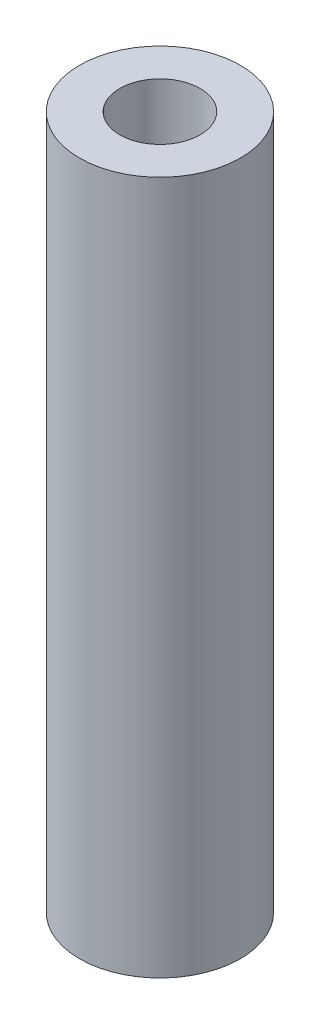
ISO-10303-21;
HEADER;
FILE_DESCRIPTION(('STEP AP214'),'2;1');
FILE_NAME('part.step','',(''),(''),'','','');
FILE_SCHEMA(('AUTOMOTIVE_DESIGN { 1 0 10303 214 1 1 1 1 }'));
ENDSEC;
DATA;
#1=APPLICATION_CONTEXT('core data for automotive mechanical design processes');
#2=APPLICATION_PROTOCOL_DEFINITION('international standard','automotive_design',2000,#1);
#3=PRODUCT_CONTEXT('',#1,'mechanical');
#4=PRODUCT('Part','Part','',(#3));
#5=PRODUCT_RELATED_PRODUCT_CATEGORY('part','',(#4));
#6=PRODUCT_DEFINITION_FORMATION('','',#4);
#7=PRODUCT_DEFINITION_CONTEXT('part definition',#1,'design');
#8=PRODUCT_DEFINITION('design','',#6,#7);
#9=PRODUCT_DEFINITION_SHAPE('','',#8);
#10=(LENGTH_UNIT() NAMED_UNIT(*) SI_UNIT(.MILLI.,.METRE.));
#11=(NAMED_UNIT(*) PLANE_ANGLE_UNIT() SI_UNIT($,.RADIAN.));
#12=(NAMED_UNIT(*) SI_UNIT($,.STERADIAN.) SOLID_ANGLE_UNIT());
#13=UNCERTAINTY_MEASURE_WITH_UNIT(LENGTH_MEASURE(1.E-05),#10,'distance_accuracy_value','');
#14=(GEOMETRIC_REPRESENTATION_CONTEXT(3) GLOBAL_UNCERTAINTY_ASSIGNED_CONTEXT((#13)) GLOBAL_UNIT_ASSIGNED_CONTEXT((#10,
#11,#12)) REPRESENTATION_CONTEXT('',''));
#15=CARTESIAN_POINT('',(0.,0.,0.));
#16=DIRECTION('',(0.,0.,1.));
#17=DIRECTION('',(1.,0.,0.));
#18=AXIS2_PLACEMENT_3D('',#15,#16,#17);
#19=CARTESIAN_POINT('',(0.,70.104,0.));
#20=DIRECTION('',(0.,-1.,0.));
#21=DIRECTION('',(0.,0.,-1.));
#22=AXIS2_PLACEMENT_3D('',#19,#20,#21);
#23=CYLINDRICAL_SURFACE('',#22,8.128);
#24=CARTESIAN_POINT('',(0.,70.104,0.));
#25=DIRECTION('',(0.,1.,0.));
#26=DIRECTION('',(0.,0.,1.));
#27=AXIS2_PLACEMENT_3D('',#24,#25,#26);
#28=CIRCLE('',#27,8.128);
#29=CARTESIAN_POINT('',(0.,70.104,8.128));
#30=VERTEX_POINT('',#29);
#31=EDGE_CURVE('E10',#30,#30,#28,.T.);
#32=ORIENTED_EDGE('',*,*,#31,.F.);
#33=EDGE_LOOP('',(#32));
#34=FACE_BOUND('',#33,.T.);
#35=CARTESIAN_POINT('',(0.,0.,0.));
#36=DIRECTION('',(0.,1.,0.));
#37=DIRECTION('',(0.,0.,1.));
#38=AXIS2_PLACEMENT_3D('',#35,#36,#37);
#39=CIRCLE('',#38,8.128);
#40=CARTESIAN_POINT('',(0.,0.,8.128));
#41=VERTEX_POINT('',#40);
#42=EDGE_CURVE('E40',#41,#41,#39,.T.);
#43=ORIENTED_EDGE('',*,*,#42,.T.);
#44=EDGE_LOOP('',(#43));
#45=FACE_BOUND('',#44,.T.);
#46=ADVANCED_FACE('F37',(#34,#45),#23,.T.);
#47=CARTESIAN_POINT('',(0.,70.104,0.));
#48=DIRECTION('',(0.,1.,0.));
#49=DIRECTION('',(0.,0.,1.));
#50=AXIS2_PLACEMENT_3D('',#47,#48,#49);
#51=PLANE('',#50);
#52=CARTESIAN_POINT('',(0.,70.104,0.));
#53=DIRECTION('',(0.,1.,0.));
#54=DIRECTION('',(0.,0.,1.));
#55=AXIS2_PLACEMENT_3D('',#52,#53,#54);
#56=CIRCLE('',#55,4.064);
#57=CARTESIAN_POINT('',(0.,70.104,4.064));
#58=VERTEX_POINT('',#57);
#59=EDGE_CURVE('E51',#58,#58,#56,.T.);
#60=ORIENTED_EDGE('',*,*,#59,.F.);
#61=EDGE_LOOP('',(#60));
#62=FACE_BOUND('',#61,.T.);
#63=ORIENTED_EDGE('',*,*,#31,.T.);
#64=EDGE_LOOP('',(#63));
#65=FACE_BOUND('',#64,.T.);
#66=ADVANCED_FACE('F68',(#62,#65),#51,.T.);
#67=CARTESIAN_POINT('',(0.,0.,0.));
#68=DIRECTION('',(0.,1.,0.));
#69=DIRECTION('',(0.,0.,1.));
#70=AXIS2_PLACEMENT_3D('',#67,#68,#69);
#71=PLANE('',#70);
#72=CARTESIAN_POINT('',(0.,0.,0.));
#73=DIRECTION('',(0.,1.,0.));
#74=DIRECTION('',(0.,0.,1.));
#75=AXIS2_PLACEMENT_3D('',#72,#73,#74);
#76=CIRCLE('',#75,4.064);
#77=CARTESIAN_POINT('',(0.,0.,4.064));
#78=VERTEX_POINT('',#77);
#79=EDGE_CURVE('E49',#78,#78,#76,.T.);
#80=ORIENTED_EDGE('',*,*,#79,.T.);
#81=EDGE_LOOP('',(#80));
#82=FACE_BOUND('',#81,.T.);
#83=ORIENTED_EDGE('',*,*,#42,.F.);
#84=EDGE_LOOP('',(#83));
#85=FACE_BOUND('',#84,.T.);
#86=ADVANCED_FACE('F59',(#82,#85),#71,.F.);
#87=CARTESIAN_POINT('',(0.,0.,0.));
#88=DIRECTION('',(0.,1.,0.));
#89=DIRECTION('',(0.,0.,1.));
#90=AXIS2_PLACEMENT_3D('',#87,#88,#89);
#91=CYLINDRICAL_SURFACE('',#90,4.064);
#92=ORIENTED_EDGE('',*,*,#79,.F.);
#93=EDGE_LOOP('',(#92));
#94=FACE_BOUND('',#93,.T.);
#95=ORIENTED_EDGE('',*,*,#59,.T.);
#96=EDGE_LOOP('',(#95));
#97=FACE_BOUND('',#96,.T.);
#98=ADVANCED_FACE('F62',(#94,#97),#91,.F.);
#99=CLOSED_SHELL('',(#46,#66,#86,#98));
#100=MANIFOLD_SOLID_BREP('B2',#99);
#101=ADVANCED_BREP_SHAPE_REPRESENTATION('',(#18,#100),#14);
#102=SHAPE_DEFINITION_REPRESENTATION(#9,#101);
ENDSEC;
END-ISO-10303-21;
